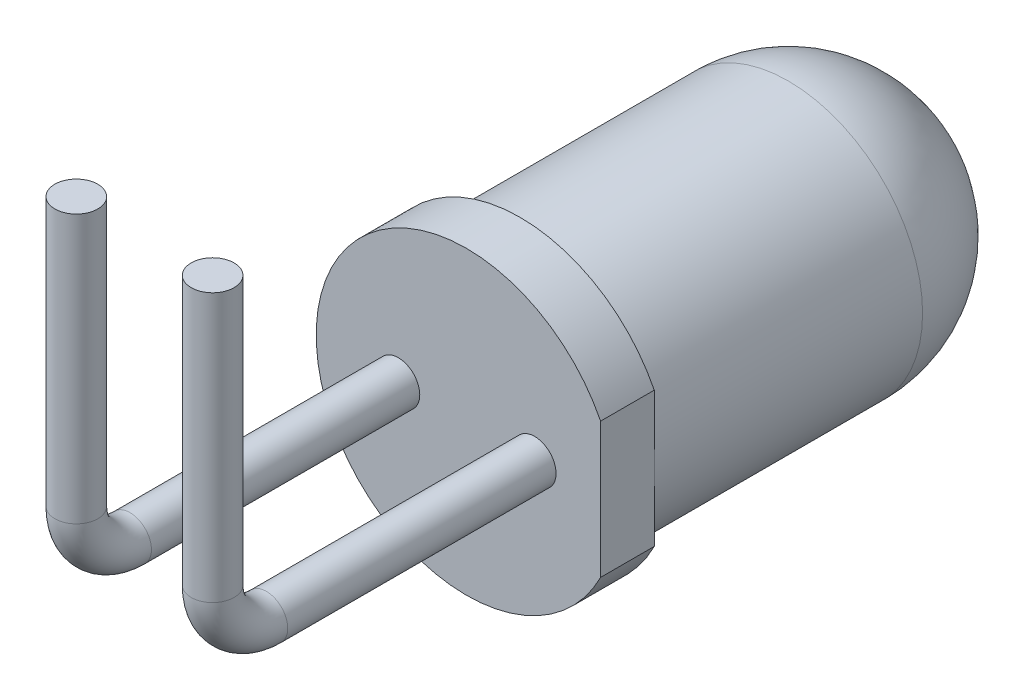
ISO-10303-21;
HEADER;
FILE_DESCRIPTION(('STEP AP214'),'2;1');
FILE_NAME('part.step','',(''),(''),'','','');
FILE_SCHEMA(('AUTOMOTIVE_DESIGN { 1 0 10303 214 1 1 1 1 }'));
ENDSEC;
DATA;
#1=APPLICATION_CONTEXT('core data for automotive mechanical design processes');
#2=APPLICATION_PROTOCOL_DEFINITION('international standard','automotive_design',2000,#1);
#3=PRODUCT_CONTEXT('',#1,'mechanical');
#4=PRODUCT('Part','Part','',(#3));
#5=PRODUCT_RELATED_PRODUCT_CATEGORY('part','',(#4));
#6=PRODUCT_DEFINITION_FORMATION('','',#4);
#7=PRODUCT_DEFINITION_CONTEXT('part definition',#1,'design');
#8=PRODUCT_DEFINITION('design','',#6,#7);
#9=PRODUCT_DEFINITION_SHAPE('','',#8);
#10=(LENGTH_UNIT() NAMED_UNIT(*) SI_UNIT(.MILLI.,.METRE.));
#11=(NAMED_UNIT(*) PLANE_ANGLE_UNIT() SI_UNIT($,.RADIAN.));
#12=(NAMED_UNIT(*) SI_UNIT($,.STERADIAN.) SOLID_ANGLE_UNIT());
#13=UNCERTAINTY_MEASURE_WITH_UNIT(LENGTH_MEASURE(1.E-05),#10,'distance_accuracy_value','');
#14=(GEOMETRIC_REPRESENTATION_CONTEXT(3) GLOBAL_UNCERTAINTY_ASSIGNED_CONTEXT((#13)) GLOBAL_UNIT_ASSIGNED_CONTEXT((#10,
#11,#12)) REPRESENTATION_CONTEXT('',''));
#15=CARTESIAN_POINT('',(0.,0.,0.));
#16=DIRECTION('',(0.,0.,1.));
#17=DIRECTION('',(1.,0.,0.));
#18=AXIS2_PLACEMENT_3D('',#15,#16,#17);
#19=CARTESIAN_POINT('',(0.,0.,8.5));
#20=DIRECTION('',(0.,0.,1.));
#21=DIRECTION('',(1.,0.,0.));
#22=AXIS2_PLACEMENT_3D('',#19,#20,#21);
#23=PLANE('',#22);
#24=CARTESIAN_POINT('',(-1.27,0.,8.5));
#25=DIRECTION('',(0.,0.,1.));
#26=DIRECTION('',(1.,0.,0.));
#27=AXIS2_PLACEMENT_3D('',#24,#25,#26);
#28=CIRCLE('',#27,0.4);
#29=CARTESIAN_POINT('',(-0.87,0.,8.5));
#30=VERTEX_POINT('',#29);
#31=EDGE_CURVE('E11',#30,#30,#28,.T.);
#32=ORIENTED_EDGE('',*,*,#31,.F.);
#33=EDGE_LOOP('',(#32));
#34=FACE_BOUND('',#33,.T.);
#35=DIRECTION('',(0.,1.,0.));
#36=VECTOR('',#35,1.);
#37=CARTESIAN_POINT('',(2.5,1.26095202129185,8.5));
#38=LINE('',#37,#36);
#39=CARTESIAN_POINT('',(2.5,-1.26095202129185,8.5));
#40=VERTEX_POINT('',#39);
#41=CARTESIAN_POINT('',(2.5,1.26095202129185,8.5));
#42=VERTEX_POINT('',#41);
#43=EDGE_CURVE('E63',#40,#42,#38,.T.);
#44=ORIENTED_EDGE('',*,*,#43,.T.);
#45=CARTESIAN_POINT('',(0.,0.,8.5));
#46=DIRECTION('',(0.,0.,1.));
#47=DIRECTION('',(1.,0.,0.));
#48=AXIS2_PLACEMENT_3D('',#45,#46,#47);
#49=CIRCLE('',#48,2.8);
#50=EDGE_CURVE('E53',#42,#40,#49,.T.);
#51=ORIENTED_EDGE('',*,*,#50,.T.);
#52=EDGE_LOOP('',(#44,#51));
#53=FACE_BOUND('',#52,.T.);
#54=CARTESIAN_POINT('',(1.27,0.,8.5));
#55=DIRECTION('',(0.,0.,1.));
#56=DIRECTION('',(1.,0.,0.));
#57=AXIS2_PLACEMENT_3D('',#54,#55,#56);
#58=CIRCLE('',#57,0.4);
#59=CARTESIAN_POINT('',(1.67,0.,8.5));
#60=VERTEX_POINT('',#59);
#61=EDGE_CURVE('E217',#60,#60,#58,.T.);
#62=ORIENTED_EDGE('',*,*,#61,.F.);
#63=EDGE_LOOP('',(#62));
#64=FACE_BOUND('',#63,.T.);
#65=ADVANCED_FACE('F17',(#34,#53,#64),#23,.T.);
#66=CARTESIAN_POINT('',(0.,0.,8.5));
#67=DIRECTION('',(0.,0.,-1.));
#68=DIRECTION('',(-1.,0.,0.));
#69=AXIS2_PLACEMENT_3D('',#66,#67,#68);
#70=CYLINDRICAL_SURFACE('',#69,2.5);
#71=CARTESIAN_POINT('',(0.,0.,2.5));
#72=DIRECTION('',(0.,0.,-1.));
#73=DIRECTION('',(-1.,0.,0.));
#74=AXIS2_PLACEMENT_3D('',#71,#72,#73);
#75=CIRCLE('',#74,2.5);
#76=CARTESIAN_POINT('',(-2.5,0.,2.5));
#77=VERTEX_POINT('',#76);
#78=EDGE_CURVE('E25',#77,#77,#75,.F.);
#79=ORIENTED_EDGE('',*,*,#78,.T.);
#80=EDGE_LOOP('',(#79));
#81=FACE_BOUND('',#80,.T.);
#82=CARTESIAN_POINT('',(0.,0.,7.5));
#83=DIRECTION('',(0.,0.,1.));
#84=DIRECTION('',(1.,0.,0.));
#85=AXIS2_PLACEMENT_3D('',#82,#83,#84);
#86=CIRCLE('',#85,2.5);
#87=CARTESIAN_POINT('',(2.5,0.,7.5));
#88=VERTEX_POINT('',#87);
#89=EDGE_CURVE('E30',#88,#88,#86,.T.);
#90=ORIENTED_EDGE('',*,*,#89,.F.);
#91=EDGE_LOOP('',(#90));
#92=FACE_BOUND('',#91,.T.);
#93=ADVANCED_FACE('F19',(#81,#92),#70,.T.);
#94=CARTESIAN_POINT('',(0.,0.,7.5));
#95=DIRECTION('',(0.,0.,1.));
#96=DIRECTION('',(1.,0.,0.));
#97=AXIS2_PLACEMENT_3D('',#94,#95,#96);
#98=PLANE('',#97);
#99=DIRECTION('',(0.,1.,0.));
#100=VECTOR('',#99,1.);
#101=CARTESIAN_POINT('',(2.5,1.26095202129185,7.5));
#102=LINE('',#101,#100);
#103=CARTESIAN_POINT('',(2.5,1.26095202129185,7.5));
#104=VERTEX_POINT('',#103);
#105=EDGE_CURVE('E37',#88,#104,#102,.T.);
#106=ORIENTED_EDGE('',*,*,#105,.F.);
#107=ORIENTED_EDGE('',*,*,#89,.T.);
#108=CARTESIAN_POINT('',(2.5,-1.26095202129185,7.5));
#109=VERTEX_POINT('',#108);
#110=EDGE_CURVE('E59',#109,#88,#102,.T.);
#111=ORIENTED_EDGE('',*,*,#110,.F.);
#112=CARTESIAN_POINT('',(0.,0.,7.5));
#113=DIRECTION('',(0.,0.,1.));
#114=DIRECTION('',(1.,0.,0.));
#115=AXIS2_PLACEMENT_3D('',#112,#113,#114);
#116=CIRCLE('',#115,2.8);
#117=EDGE_CURVE('E55',#104,#109,#116,.T.);
#118=ORIENTED_EDGE('',*,*,#117,.F.);
#119=EDGE_LOOP('',(#106,#107,#111,#118));
#120=FACE_BOUND('',#119,.T.);
#121=ADVANCED_FACE('F99',(#120),#98,.F.);
#122=CARTESIAN_POINT('',(2.5,1.26095202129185,7.5));
#123=DIRECTION('',(1.,0.,0.));
#124=DIRECTION('',(0.,0.,-1.));
#125=AXIS2_PLACEMENT_3D('',#122,#123,#124);
#126=PLANE('',#125);
#127=ORIENTED_EDGE('',*,*,#110,.T.);
#128=ORIENTED_EDGE('',*,*,#105,.T.);
#129=DIRECTION('',(0.,0.,1.));
#130=VECTOR('',#129,1.);
#131=CARTESIAN_POINT('',(2.5,1.26095202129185,7.5));
#132=LINE('',#131,#130);
#133=EDGE_CURVE('E58',#104,#42,#132,.T.);
#134=ORIENTED_EDGE('',*,*,#133,.T.);
#135=ORIENTED_EDGE('',*,*,#43,.F.);
#136=DIRECTION('',(0.,0.,1.));
#137=VECTOR('',#136,1.);
#138=CARTESIAN_POINT('',(2.5,-1.26095202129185,7.5));
#139=LINE('',#138,#137);
#140=EDGE_CURVE('E50',#109,#40,#139,.T.);
#141=ORIENTED_EDGE('',*,*,#140,.F.);
#142=EDGE_LOOP('',(#127,#128,#134,#135,#141));
#143=FACE_BOUND('',#142,.T.);
#144=ADVANCED_FACE('F66',(#143),#126,.T.);
#145=CARTESIAN_POINT('',(0.,0.,7.5));
#146=DIRECTION('',(0.,0.,1.));
#147=DIRECTION('',(1.,0.,0.));
#148=AXIS2_PLACEMENT_3D('',#145,#146,#147);
#149=CYLINDRICAL_SURFACE('',#148,2.8);
#150=ORIENTED_EDGE('',*,*,#50,.F.);
#151=ORIENTED_EDGE('',*,*,#133,.F.);
#152=ORIENTED_EDGE('',*,*,#117,.T.);
#153=ORIENTED_EDGE('',*,*,#140,.T.);
#154=EDGE_LOOP('',(#150,#151,#152,#153));
#155=FACE_BOUND('',#154,.T.);
#156=ADVANCED_FACE('F52',(#155),#149,.T.);
#157=CARTESIAN_POINT('',(0.,0.,2.5));
#158=DIRECTION('',(0.,0.,1.));
#159=DIRECTION('',(1.,0.,0.));
#160=AXIS2_PLACEMENT_3D('',#157,#158,#159);
#161=SPHERICAL_SURFACE('',#160,2.5);
#162=ORIENTED_EDGE('',*,*,#78,.F.);
#163=EDGE_LOOP('',(#162));
#164=FACE_BOUND('',#163,.T.);
#165=ADVANCED_FACE('F77',(#164),#161,.T.);
#166=CARTESIAN_POINT('',(1.27,1.00000000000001,14.5));
#167=DIRECTION('',(0.,1.,0.));
#168=DIRECTION('',(0.,0.,1.));
#169=AXIS2_PLACEMENT_3D('',#166,#167,#168);
#170=CYLINDRICAL_SURFACE('',#169,0.4);
#171=CARTESIAN_POINT('',(1.27,1.00000000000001,14.5));
#172=DIRECTION('',(0.,1.,0.));
#173=DIRECTION('',(1.,0.,0.));
#174=AXIS2_PLACEMENT_3D('',#171,#172,#173);
#175=CIRCLE('',#174,0.4);
#176=CARTESIAN_POINT('',(1.27,1.00000000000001,14.9));
#177=VERTEX_POINT('',#176);
#178=EDGE_CURVE('E230',#177,#177,#175,.T.);
#179=ORIENTED_EDGE('',*,*,#178,.T.);
#180=EDGE_LOOP('',(#179));
#181=FACE_BOUND('',#180,.T.);
#182=CARTESIAN_POINT('',(1.27,6.,14.5));
#183=DIRECTION('',(0.,1.,0.));
#184=DIRECTION('',(1.,0.,0.));
#185=AXIS2_PLACEMENT_3D('',#182,#183,#184);
#186=CIRCLE('',#185,0.4);
#187=CARTESIAN_POINT('',(1.67,6.,14.5));
#188=VERTEX_POINT('',#187);
#189=EDGE_CURVE('E64',#188,#188,#186,.T.);
#190=ORIENTED_EDGE('',*,*,#189,.F.);
#191=EDGE_LOOP('',(#190));
#192=FACE_BOUND('',#191,.T.);
#193=ADVANCED_FACE('F79',(#181,#192),#170,.T.);
#194=CARTESIAN_POINT('',(1.27,1.,13.5));
#195=DIRECTION('',(-1.,0.,0.));
#196=DIRECTION('',(0.,0.,1.));
#197=AXIS2_PLACEMENT_3D('',#194,#195,#196);
#198=TOROIDAL_SURFACE('',#197,1.,0.4);
#199=CARTESIAN_POINT('',(1.27,0.,13.5));
#200=DIRECTION('',(0.,0.,1.));
#201=DIRECTION('',(1.,0.,0.));
#202=AXIS2_PLACEMENT_3D('',#199,#200,#201);
#203=CIRCLE('',#202,0.4);
#204=CARTESIAN_POINT('',(1.27,-0.399999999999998,13.5));
#205=VERTEX_POINT('',#204);
#206=EDGE_CURVE('E221',#205,#205,#203,.T.);
#207=CARTESIAN_POINT('',(1.27,1.,13.5));
#208=DIRECTION('',(-1.,0.,0.));
#209=DIRECTION('',(0.,0.,1.));
#210=AXIS2_PLACEMENT_3D('',#207,#208,#209);
#211=CIRCLE('',#210,1.4);
#212=EDGE_CURVE('',#205,#177,#211,.T.);
#213=ORIENTED_EDGE('',*,*,#206,.T.);
#214=ORIENTED_EDGE('',*,*,#178,.F.);
#215=ORIENTED_EDGE('',*,*,#212,.T.);
#216=ORIENTED_EDGE('',*,*,#212,.F.);
#217=EDGE_LOOP('',(#213,#215,#214,#216));
#218=FACE_BOUND('',#217,.T.);
#219=ADVANCED_FACE('F88',(#218),#198,.T.);
#220=CARTESIAN_POINT('',(1.27,0.,13.5));
#221=DIRECTION('',(0.,0.,-1.));
#222=DIRECTION('',(0.,1.,0.));
#223=AXIS2_PLACEMENT_3D('',#220,#221,#222);
#224=CYLINDRICAL_SURFACE('',#223,0.4);
#225=ORIENTED_EDGE('',*,*,#206,.F.);
#226=EDGE_LOOP('',(#225));
#227=FACE_BOUND('',#226,.T.);
#228=ORIENTED_EDGE('',*,*,#61,.T.);
#229=EDGE_LOOP('',(#228));
#230=FACE_BOUND('',#229,.T.);
#231=ADVANCED_FACE('F145',(#227,#230),#224,.T.);
#232=CARTESIAN_POINT('',(1.27,6.,14.5));
#233=DIRECTION('',(0.,1.,0.));
#234=DIRECTION('',(1.,0.,0.));
#235=AXIS2_PLACEMENT_3D('',#232,#233,#234);
#236=PLANE('',#235);
#237=ORIENTED_EDGE('',*,*,#189,.T.);
#238=EDGE_LOOP('',(#237));
#239=FACE_BOUND('',#238,.T.);
#240=ADVANCED_FACE('F156',(#239),#236,.T.);
#241=CARTESIAN_POINT('',(-1.27,1.00000000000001,14.5));
#242=DIRECTION('',(0.,1.,0.));
#243=DIRECTION('',(0.,0.,1.));
#244=AXIS2_PLACEMENT_3D('',#241,#242,#243);
#245=CYLINDRICAL_SURFACE('',#244,0.4);
#246=CARTESIAN_POINT('',(-1.27,1.00000000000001,14.5));
#247=DIRECTION('',(0.,-1.,0.));
#248=DIRECTION('',(-1.,0.,0.));
#249=AXIS2_PLACEMENT_3D('',#246,#247,#248);
#250=CIRCLE('',#249,0.4);
#251=CARTESIAN_POINT('',(-1.27,1.00000000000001,14.9));
#252=VERTEX_POINT('',#251);
#253=EDGE_CURVE('E218',#252,#252,#250,.T.);
#254=ORIENTED_EDGE('',*,*,#253,.F.);
#255=EDGE_LOOP('',(#254));
#256=FACE_BOUND('',#255,.T.);
#257=CARTESIAN_POINT('',(-1.27,6.,14.5));
#258=DIRECTION('',(0.,-1.,0.));
#259=DIRECTION('',(-1.,0.,0.));
#260=AXIS2_PLACEMENT_3D('',#257,#258,#259);
#261=CIRCLE('',#260,0.4);
#262=CARTESIAN_POINT('',(-1.67,6.,14.5));
#263=VERTEX_POINT('',#262);
#264=EDGE_CURVE('E215',#263,#263,#261,.T.);
#265=ORIENTED_EDGE('',*,*,#264,.T.);
#266=EDGE_LOOP('',(#265));
#267=FACE_BOUND('',#266,.T.);
#268=ADVANCED_FACE('F167',(#256,#267),#245,.T.);
#269=CARTESIAN_POINT('',(-1.27,1.,13.5));
#270=DIRECTION('',(-1.,0.,0.));
#271=DIRECTION('',(0.,0.,1.));
#272=AXIS2_PLACEMENT_3D('',#269,#270,#271);
#273=TOROIDAL_SURFACE('',#272,1.,0.4);
#274=CARTESIAN_POINT('',(-1.27,0.,13.5));
#275=DIRECTION('',(0.,0.,-1.));
#276=DIRECTION('',(-1.,0.,0.));
#277=AXIS2_PLACEMENT_3D('',#274,#275,#276);
#278=CIRCLE('',#277,0.4);
#279=CARTESIAN_POINT('',(-1.27,-0.399999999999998,13.5));
#280=VERTEX_POINT('',#279);
#281=EDGE_CURVE('E224',#280,#280,#278,.T.);
#282=CARTESIAN_POINT('',(-1.27,1.,13.5));
#283=DIRECTION('',(-1.,0.,0.));
#284=DIRECTION('',(0.,0.,1.));
#285=AXIS2_PLACEMENT_3D('',#282,#283,#284);
#286=CIRCLE('',#285,1.4);
#287=EDGE_CURVE('',#280,#252,#286,.T.);
#288=ORIENTED_EDGE('',*,*,#281,.F.);
#289=ORIENTED_EDGE('',*,*,#253,.T.);
#290=ORIENTED_EDGE('',*,*,#287,.T.);
#291=ORIENTED_EDGE('',*,*,#287,.F.);
#292=EDGE_LOOP('',(#288,#290,#289,#291));
#293=FACE_BOUND('',#292,.T.);
#294=ADVANCED_FACE('F177',(#293),#273,.T.);
#295=CARTESIAN_POINT('',(-1.27,0.,13.5));
#296=DIRECTION('',(0.,0.,-1.));
#297=DIRECTION('',(0.,1.,0.));
#298=AXIS2_PLACEMENT_3D('',#295,#296,#297);
#299=CYLINDRICAL_SURFACE('',#298,0.4);
#300=ORIENTED_EDGE('',*,*,#281,.T.);
#301=EDGE_LOOP('',(#300));
#302=FACE_BOUND('',#301,.T.);
#303=ORIENTED_EDGE('',*,*,#31,.T.);
#304=EDGE_LOOP('',(#303));
#305=FACE_BOUND('',#304,.T.);
#306=ADVANCED_FACE('F187',(#302,#305),#299,.T.);
#307=CARTESIAN_POINT('',(-1.27,6.,14.5));
#308=DIRECTION('',(0.,1.,0.));
#309=DIRECTION('',(-1.,0.,0.));
#310=AXIS2_PLACEMENT_3D('',#307,#308,#309);
#311=PLANE('',#310);
#312=ORIENTED_EDGE('',*,*,#264,.F.);
#313=EDGE_LOOP('',(#312));
#314=FACE_BOUND('',#313,.T.);
#315=ADVANCED_FACE('F197',(#314),#311,.T.);
#316=CLOSED_SHELL('',(#65,#93,#121,#144,#156,#165,#193,#219,#231,#240,#268,#294,#306,#315));
#317=MANIFOLD_SOLID_BREP('B1',#316);
#318=ADVANCED_BREP_SHAPE_REPRESENTATION('',(#18,#317),#14);
#319=SHAPE_DEFINITION_REPRESENTATION(#9,#318);
ENDSEC;
END-ISO-10303-21;
